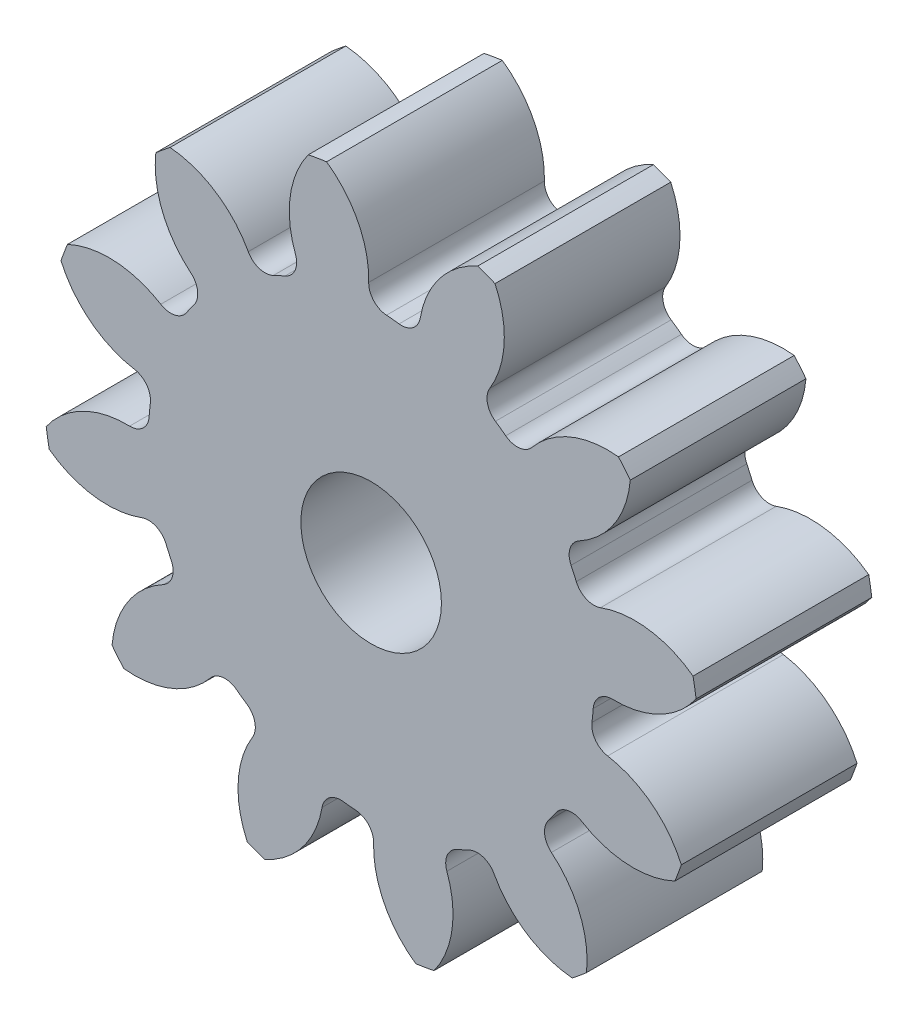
from build123d import *

# Parameters (mm, degrees)
SKETCH3_R         = 237.066666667
GEARBODY_DEPTH    = 127
TOOTHCUT_DEPTH    = 359.511100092
CIRPATTERN1_COUNT = 12
BOREDIA_R         = 50.8
BORE_DEPTH        = 12700


with BuildPart() as part:
    # Sketch3 → gearBody (new body)
    with BuildSketch(Plane.XY):
        Circle(SKETCH3_R)
    extrude(amount=GEARBODY_DEPTH)

    # Sketch2 → toothCut (cut, through all)
    with BuildSketch(Plane.XY):
        with BuildLine():
            ThreePointArc((159.595993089, -20.179282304), (160.105819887, -15.627248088), (160.485839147, -11.06254391))
            ThreePointArc((160.485839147, -11.06254391), (164.96091837, -1.815003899), (174.588982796, 1.768807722))
            ThreePointArc((174.588982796, 1.768807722), (210.330763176, 10.327388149), (237.066666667, 35.544755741))
            ThreePointArc((237.066666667, 35.544755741), (238.582789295, -23.28705128), (225.719017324, -80.715297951))
            ThreePointArc((225.719017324, -80.715297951), (204.363990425, -50.803979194), (170.951765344, -35.495570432))
            ThreePointArc((170.951765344, -35.495570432), (162.198419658, -30.117627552), (159.595993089, -20.179282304))
        make_face()
    toothcut = extrude(amount=TOOTHCUT_DEPTH, mode=Mode.SUBTRACT)

    # CirPattern1: toothCut ×12 about axis
    cirpattern1_axis = Axis((0, 0, 0), (0, 0, 1))
    for i in range(1, CIRPATTERN1_COUNT):
        add(toothcut.rotate(cirpattern1_axis, i * 360 / CIRPATTERN1_COUNT), mode=Mode.SUBTRACT)

    # boreDia → bore (cut, symmetric)
    with BuildSketch(Plane.XY):
        Circle(BOREDIA_R)
    extrude(amount=BORE_DEPTH, both=True, mode=Mode.SUBTRACT)


solid = part.part
